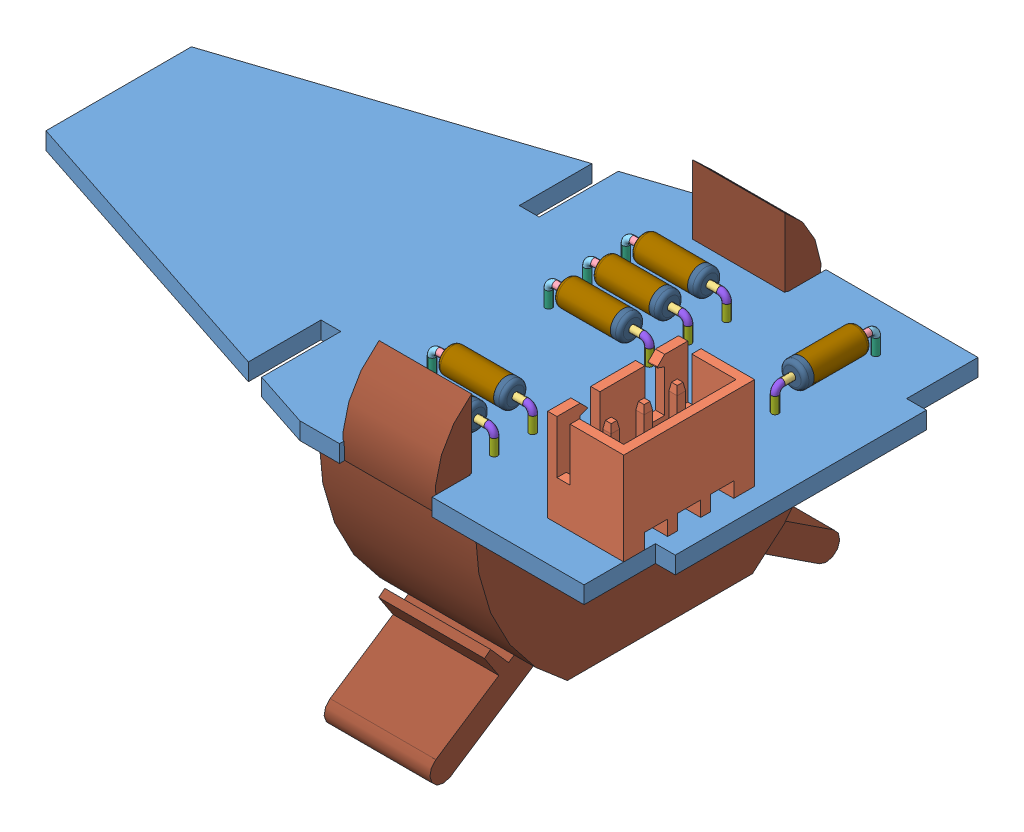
SolidWorks assembly Circuit-Redresseur.SLDASM, configuration Défaut (file format 4400). Lengths in mm.
Overall size (51.6 25.74 31).
57 component instances, 11 part files, 19 mates.
Components (placement in the parent):
- Circuit-1: Circuit.SLDPRT [Défaut] at origin size (51.6 1.3 29.8)
- User Library-jst-b3b-xh-a-1: User Library-jst-b3b-xh-a.SLDPRT [Default] at (47.225 1.3 6.95) x (0 0 1) z (-1 0 0) size (9.9 10.4 5.75)
- User Library-DO-35_300mils-1: User Library-DO-35_300mils.SLDASM [Default] at (30.5184 1.5 -4.9268) x (1 0 0) z (0 1 0) size (8.16 1.92 4.46)
  - User Library-DO-35_300mils_Cylinder001-1: User Library-DO-35_300mils_Cylinder001.sldprt [Default] at origin size (1 0.52 0.52)
  - User Library-DO-35_300mils_Cylinder002-1: User Library-DO-35_300mils_Cylinder002.sldprt [Default] at origin size (1 0.52 0.52)
  - User Library-DO-35_300mils_Torus-1: User Library-DO-35_300mils_Torus.sldprt [Default] at origin size (0.77 0.55 0.77)
  - User Library-DO-35_300mils_Cylinder003-1: User Library-DO-35_300mils_Cylinder003.sldprt [Default] at origin size (0.52 0.52 3)
  - User Library-DO-35_300mils_Cylinder004-1: User Library-DO-35_300mils_Cylinder004.sldprt [Default] at origin size (0.52 0.52 3)
  - User Library-DO-35_300mils_Torus_(Mirror_#1)-1: User Library-DO-35_300mils_Torus_(Mirror_#1).sldprt [Default] at origin size (0.77 0.55 0.77)
  - User Library-DO-35_300mils_Fillet-1: User Library-DO-35_300mils_Fillet.sldprt [Default] at origin size (4.32 1.92 1.92)
  - User Library-DO-35_300mils_Fillet001-1: User Library-DO-35_300mils_Fillet001.sldprt [Default] at origin size (0.7 1.92 1.92)
- User Library-DO-35_300mils-2: User Library-DO-35_300mils.SLDASM [Default] at (30.5184 1.5 6.821) x (1 0 0) z (0 1 0) size (8.16 1.92 4.46)
  - User Library-DO-35_300mils_Cylinder001-1: User Library-DO-35_300mils_Cylinder001.sldprt [Default] at origin size (1 0.52 0.52)
  - User Library-DO-35_300mils_Cylinder002-1: User Library-DO-35_300mils_Cylinder002.sldprt [Default] at origin size (1 0.52 0.52)
  - User Library-DO-35_300mils_Torus-1: User Library-DO-35_300mils_Torus.sldprt [Default] at origin size (0.77 0.55 0.77)
  - User Library-DO-35_300mils_Cylinder003-1: User Library-DO-35_300mils_Cylinder003.sldprt [Default] at origin size (0.52 0.52 3)
  - User Library-DO-35_300mils_Cylinder004-1: User Library-DO-35_300mils_Cylinder004.sldprt [Default] at origin size (0.52 0.52 3)
  - User Library-DO-35_300mils_Torus_(Mirror_#1)-1: User Library-DO-35_300mils_Torus_(Mirror_#1).sldprt [Default] at origin size (0.77 0.55 0.77)
  - User Library-DO-35_300mils_Fillet-1: User Library-DO-35_300mils_Fillet.sldprt [Default] at origin size (4.32 1.92 1.92)
  - User Library-DO-35_300mils_Fillet001-1: User Library-DO-35_300mils_Fillet001.sldprt [Default] at origin size (0.7 1.92 1.92)
- User Library-DO-35_300mils-3: User Library-DO-35_300mils.SLDASM [Default] at (30.5184 1.5 9.741) x (1 0 0) z (0 1 0) size (8.16 1.92 4.46)
  - User Library-DO-35_300mils_Cylinder001-1: User Library-DO-35_300mils_Cylinder001.sldprt [Default] at origin size (1 0.52 0.52)
  - User Library-DO-35_300mils_Cylinder002-1: User Library-DO-35_300mils_Cylinder002.sldprt [Default] at origin size (1 0.52 0.52)
  - User Library-DO-35_300mils_Torus-1: User Library-DO-35_300mils_Torus.sldprt [Default] at origin size (0.77 0.55 0.77)
  - User Library-DO-35_300mils_Cylinder003-1: User Library-DO-35_300mils_Cylinder003.sldprt [Default] at origin size (0.52 0.52 3)
  - User Library-DO-35_300mils_Cylinder004-1: User Library-DO-35_300mils_Cylinder004.sldprt [Default] at origin size (0.52 0.52 3)
  - User Library-DO-35_300mils_Torus_(Mirror_#1)-1: User Library-DO-35_300mils_Torus_(Mirror_#1).sldprt [Default] at origin size (0.77 0.55 0.77)
  - User Library-DO-35_300mils_Fillet-1: User Library-DO-35_300mils_Fillet.sldprt [Default] at origin size (4.32 1.92 1.92)
  - User Library-DO-35_300mils_Fillet001-1: User Library-DO-35_300mils_Fillet001.sldprt [Default] at origin size (0.7 1.92 1.92)
- User Library-DO-35_300mils-4: User Library-DO-35_300mils.SLDASM [Default] at (30.5184 1.5 -7.8468) x (1 0 0) z (0 1 0) size (8.16 1.92 4.46)
  - User Library-DO-35_300mils_Cylinder001-1: User Library-DO-35_300mils_Cylinder001.sldprt [Default] at origin size (1 0.52 0.52)
  - User Library-DO-35_300mils_Cylinder002-1: User Library-DO-35_300mils_Cylinder002.sldprt [Default] at origin size (1 0.52 0.52)
  - User Library-DO-35_300mils_Torus-1: User Library-DO-35_300mils_Torus.sldprt [Default] at origin size (0.77 0.55 0.77)
  - User Library-DO-35_300mils_Cylinder003-1: User Library-DO-35_300mils_Cylinder003.sldprt [Default] at origin size (0.52 0.52 3)
  - User Library-DO-35_300mils_Cylinder004-1: User Library-DO-35_300mils_Cylinder004.sldprt [Default] at origin size (0.52 0.52 3)
  - User Library-DO-35_300mils_Torus_(Mirror_#1)-1: User Library-DO-35_300mils_Torus_(Mirror_#1).sldprt [Default] at origin size (0.77 0.55 0.77)
  - User Library-DO-35_300mils_Fillet-1: User Library-DO-35_300mils_Fillet.sldprt [Default] at origin size (4.32 1.92 1.92)
  - User Library-DO-35_300mils_Fillet001-1: User Library-DO-35_300mils_Fillet001.sldprt [Default] at origin size (0.7 1.92 1.92)
- User Library-DO-35_300mils-5: User Library-DO-35_300mils.SLDASM [Default] at (30.5184 1.5 -2.0068) x (1 0 0) z (0 1 0) size (8.16 1.92 4.46)
  - User Library-DO-35_300mils_Cylinder001-1: User Library-DO-35_300mils_Cylinder001.sldprt [Default] at origin size (1 0.52 0.52)
  - User Library-DO-35_300mils_Cylinder002-1: User Library-DO-35_300mils_Cylinder002.sldprt [Default] at origin size (1 0.52 0.52)
  - User Library-DO-35_300mils_Torus-1: User Library-DO-35_300mils_Torus.sldprt [Default] at origin size (0.77 0.55 0.77)
  - User Library-DO-35_300mils_Cylinder003-1: User Library-DO-35_300mils_Cylinder003.sldprt [Default] at origin size (0.52 0.52 3)
  - User Library-DO-35_300mils_Cylinder004-1: User Library-DO-35_300mils_Cylinder004.sldprt [Default] at origin size (0.52 0.52 3)
  - User Library-DO-35_300mils_Torus_(Mirror_#1)-1: User Library-DO-35_300mils_Torus_(Mirror_#1).sldprt [Default] at origin size (0.77 0.55 0.77)
  - User Library-DO-35_300mils_Fillet-1: User Library-DO-35_300mils_Fillet.sldprt [Default] at origin size (4.32 1.92 1.92)
  - User Library-DO-35_300mils_Fillet001-1: User Library-DO-35_300mils_Fillet001.sldprt [Default] at origin size (0.7 1.92 1.92)
- User Library-DO-35_300mils-6: User Library-DO-35_300mils.SLDASM [Default] at (46.0064 1.5 -11.2646) x (0 0 1) z (0 1 0) size (8.16 1.92 4.46)
  - User Library-DO-35_300mils_Cylinder001-1: User Library-DO-35_300mils_Cylinder001.sldprt [Default] at origin size (1 0.52 0.52)
  - User Library-DO-35_300mils_Cylinder002-1: User Library-DO-35_300mils_Cylinder002.sldprt [Default] at origin size (1 0.52 0.52)
  - User Library-DO-35_300mils_Torus-1: User Library-DO-35_300mils_Torus.sldprt [Default] at origin size (0.77 0.55 0.77)
  - User Library-DO-35_300mils_Cylinder003-1: User Library-DO-35_300mils_Cylinder003.sldprt [Default] at origin size (0.52 0.52 3)
  - User Library-DO-35_300mils_Cylinder004-1: User Library-DO-35_300mils_Cylinder004.sldprt [Default] at origin size (0.52 0.52 3)
  - User Library-DO-35_300mils_Torus_(Mirror_#1)-1: User Library-DO-35_300mils_Torus_(Mirror_#1).sldprt [Default] at origin size (0.77 0.55 0.77)
  - User Library-DO-35_300mils_Fillet-1: User Library-DO-35_300mils_Fillet.sldprt [Default] at origin size (4.32 1.92 1.92)
  - User Library-DO-35_300mils_Fillet001-1: User Library-DO-35_300mils_Fillet001.sldprt [Default] at origin size (0.7 1.92 1.92)
- Cosse-1: Cosse.SLDPRT [Défaut] at (35.0403 0 0) x (0 0 -1) z (-1 0 0) size (31 23.94 11.8)
Mates (geometry in assembly coordinates):
- Coïncidente1: coincident anti-aligned: plane of Circuit-1 through (50.1 1.3 14.9) normal (0 1 0); plane of User Library-jst-b3b-xh-a-1 through (50.1 1.3 2) normal (0 -1 0)
- Coïncidente2: coincident aligned: plane of Circuit-1 through (50.1 1.3 14.9) normal (1 0 0); plane of User Library-jst-b3b-xh-a-1 through (50.1 8.3 2) normal (1 0 0)
- Distance1: distance = 3 mm aligned: plane of User Library-jst-b3b-xh-a-1 through (50.1 8.3 11.9) normal (0 0 1); plane of Circuit-1 through (38.6 1.3 14.9) normal (0 0 1)
- Distance2: distance = 0.5 mm aligned: plane of Circuit-1 through (50.1 0 14.9) normal (0 -1 0); plane of User Library-DO-35_300mils-1/User Library-DO-35_300mils_Cylinder004-1 through (38.1384 -0.5 -4.9268) normal (0 -1 0)
- Distance3: distance = 0.5 mm aligned: plane of Circuit-1 through (50.1 0 14.9) normal (0 -1 0); plane of User Library-DO-35_300mils-5/User Library-DO-35_300mils_Cylinder004-1 through (38.1384 -0.5 -2.0068) normal (0 -1 0)
- Distance4: distance = 0.5 mm aligned: plane of Circuit-1 through (50.1 0 14.9) normal (0 -1 0); plane of User Library-DO-35_300mils-2/User Library-DO-35_300mils_Cylinder004-1 through (38.1384 -0.5 6.821) normal (0 -1 0)
- Distance5: distance = 0.5 mm aligned: plane of User Library-DO-35_300mils-4/User Library-DO-35_300mils_Cylinder004-1 through (38.1384 -0.5 -7.8468) normal (0 -1 0); plane of Circuit-1 through (50.1 0 14.9) normal (0 -1 0)
- Distance6: distance = 0.5 mm aligned: plane of Circuit-1 through (50.1 0 14.9) normal (0 -1 0); plane of User Library-DO-35_300mils-3/User Library-DO-35_300mils_Cylinder004-1 through (38.1384 -0.5 9.741) normal (0 -1 0)
- Distance7: distance = 0.5 mm aligned: plane of Circuit-1 through (50.1 0 14.9) normal (0 -1 0); plane of User Library-DO-35_300mils-6/User Library-DO-35_300mils_Cylinder004-1 through (46.0064 -0.5 -3.6446) normal (0 -1 0)
- Coïncidente9: coincident aligned: plane of User Library-DO-35_300mils-2/User Library-DO-35_300mils_Fillet001-1 through (36.8384 3 6.821) normal (1 0 0); plane of User Library-DO-35_300mils-3/User Library-DO-35_300mils_Fillet001-1 through (36.8384 3 9.741) normal (1 0 0)
- Coïncidente10: coincident aligned: plane of User Library-DO-35_300mils-2/User Library-DO-35_300mils_Fillet001-1 through (36.8384 3 6.821) normal (1 0 0); plane of User Library-DO-35_300mils-5/User Library-DO-35_300mils_Fillet001-1 through (36.8384 3 -2.0068) normal (1 0 0)
- Coïncidente11: coincident aligned: plane of User Library-DO-35_300mils-1/User Library-DO-35_300mils_Fillet001-1 through (36.8384 3 -4.9268) normal (1 0 0); plane of User Library-DO-35_300mils-5/User Library-DO-35_300mils_Fillet001-1 through (36.8384 3 -2.0068) normal (1 0 0)
- Coïncidente12: coincident aligned: plane of User Library-DO-35_300mils-1/User Library-DO-35_300mils_Fillet001-1 through (36.8384 3 -4.9268) normal (1 0 0); plane of User Library-DO-35_300mils-4/User Library-DO-35_300mils_Fillet001-1 through (36.8384 3 -7.8468) normal (1 0 0)
- Perpendiculaire1: perpendicular: plane of Circuit-1 through (51.6 1.3 -9.5) normal (1 0 0); plane of User Library-DO-35_300mils-6/User Library-DO-35_300mils_Fillet001-1 through (46.0064 3 -4.9446) normal (0 0 1)
- Distance10: distance = 1 mm: cylinder of User Library-DO-35_300mils-4/User Library-DO-35_300mils_Fillet-1 through (31.8184 3 -7.8468) axis (1 0 0) radius 0.96; cylinder of User Library-DO-35_300mils-1/User Library-DO-35_300mils_Fillet-1 through (31.8184 3 -4.9268) axis (1 0 0) radius 0.96
- Distance11: distance = 1 mm: cylinder of User Library-DO-35_300mils-1/User Library-DO-35_300mils_Fillet-1 through (31.8184 3 -4.9268) axis (1 0 0) radius 0.96; cylinder of User Library-DO-35_300mils-5/User Library-DO-35_300mils_Fillet-1 through (31.8184 3 -2.0068) axis (1 0 0) radius 0.96
- Distance12: distance = 1 mm: cylinder of User Library-DO-35_300mils-2/User Library-DO-35_300mils_Fillet-1 through (31.8184 3 6.821) axis (1 0 0) radius 0.96; cylinder of User Library-DO-35_300mils-3/User Library-DO-35_300mils_Fillet-1 through (31.8184 3 9.741) axis (1 0 0) radius 0.96
- Coïncidente13: coincident anti-aligned: plane of Circuit-1 through (50.1 0 14.9) normal (0 -1 0); plane of Cosse-1 through (40.9403 0 14) normal (0 1 0)
- Distance13: distance = 2 mm: plane of Circuit-1 through (31.6 1.3 12) normal (0 0 1); line of Cosse-1 through (40.9403 0 14) axis (-1 0 0)
